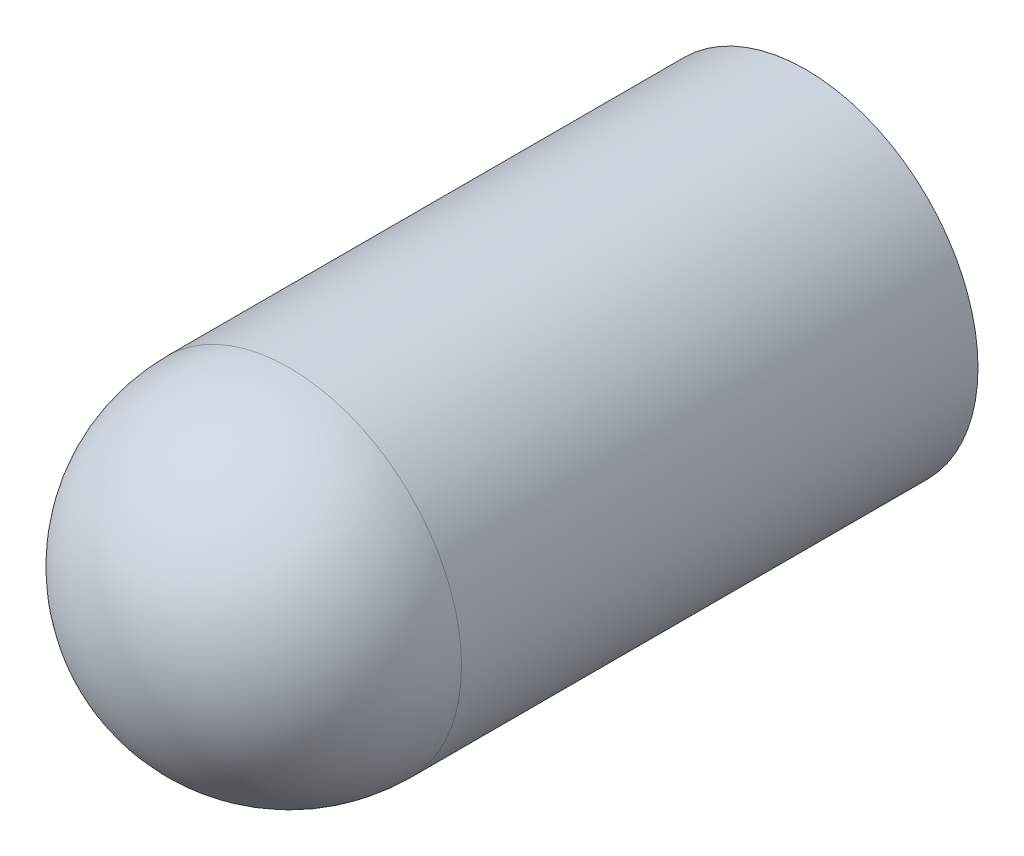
ISO-10303-21;
HEADER;
FILE_DESCRIPTION(('STEP AP214'),'2;1');
FILE_NAME('part.step','',(''),(''),'','','');
FILE_SCHEMA(('AUTOMOTIVE_DESIGN { 1 0 10303 214 1 1 1 1 }'));
ENDSEC;
DATA;
#1=APPLICATION_CONTEXT('core data for automotive mechanical design processes');
#2=APPLICATION_PROTOCOL_DEFINITION('international standard','automotive_design',2000,#1);
#3=PRODUCT_CONTEXT('',#1,'mechanical');
#4=PRODUCT('Part','Part','',(#3));
#5=PRODUCT_RELATED_PRODUCT_CATEGORY('part','',(#4));
#6=PRODUCT_DEFINITION_FORMATION('','',#4);
#7=PRODUCT_DEFINITION_CONTEXT('part definition',#1,'design');
#8=PRODUCT_DEFINITION('design','',#6,#7);
#9=PRODUCT_DEFINITION_SHAPE('','',#8);
#10=(LENGTH_UNIT() NAMED_UNIT(*) SI_UNIT(.MILLI.,.METRE.));
#11=(NAMED_UNIT(*) PLANE_ANGLE_UNIT() SI_UNIT($,.RADIAN.));
#12=(NAMED_UNIT(*) SI_UNIT($,.STERADIAN.) SOLID_ANGLE_UNIT());
#13=UNCERTAINTY_MEASURE_WITH_UNIT(LENGTH_MEASURE(1.E-05),#10,'distance_accuracy_value','');
#14=(GEOMETRIC_REPRESENTATION_CONTEXT(3) GLOBAL_UNCERTAINTY_ASSIGNED_CONTEXT((#13)) GLOBAL_UNIT_ASSIGNED_CONTEXT((#10,
#11,#12)) REPRESENTATION_CONTEXT('',''));
#15=CARTESIAN_POINT('',(0.,0.,0.));
#16=DIRECTION('',(0.,0.,1.));
#17=DIRECTION('',(1.,0.,0.));
#18=AXIS2_PLACEMENT_3D('',#15,#16,#17);
#19=CARTESIAN_POINT('',(0.,0.,40.));
#20=DIRECTION('',(0.,0.,-1.));
#21=DIRECTION('',(-1.,0.,0.));
#22=AXIS2_PLACEMENT_3D('',#19,#20,#21);
#23=CYLINDRICAL_SURFACE('',#22,10.);
#24=CARTESIAN_POINT('',(0.,0.,30.));
#25=DIRECTION('',(0.,0.,-1.));
#26=DIRECTION('',(-1.,0.,0.));
#27=AXIS2_PLACEMENT_3D('',#24,#25,#26);
#28=CIRCLE('',#27,10.);
#29=CARTESIAN_POINT('',(-10.,0.,30.));
#30=VERTEX_POINT('',#29);
#31=EDGE_CURVE('E10',#30,#30,#28,.T.);
#32=ORIENTED_EDGE('',*,*,#31,.T.);
#33=EDGE_LOOP('',(#32));
#34=FACE_BOUND('',#33,.T.);
#35=CARTESIAN_POINT('',(0.,0.,0.));
#36=DIRECTION('',(0.,0.,1.));
#37=DIRECTION('',(1.,0.,0.));
#38=AXIS2_PLACEMENT_3D('',#35,#36,#37);
#39=CIRCLE('',#38,10.);
#40=CARTESIAN_POINT('',(10.,0.,0.));
#41=VERTEX_POINT('',#40);
#42=EDGE_CURVE('E35',#41,#41,#39,.T.);
#43=ORIENTED_EDGE('',*,*,#42,.T.);
#44=EDGE_LOOP('',(#43));
#45=FACE_BOUND('',#44,.T.);
#46=ADVANCED_FACE('F29',(#34,#45),#23,.T.);
#47=CARTESIAN_POINT('',(0.,0.,0.));
#48=DIRECTION('',(0.,0.,1.));
#49=DIRECTION('',(1.,0.,0.));
#50=AXIS2_PLACEMENT_3D('',#47,#48,#49);
#51=PLANE('',#50);
#52=ORIENTED_EDGE('',*,*,#42,.F.);
#53=EDGE_LOOP('',(#52));
#54=FACE_BOUND('',#53,.T.);
#55=ADVANCED_FACE('F42',(#54),#51,.F.);
#56=CARTESIAN_POINT('',(0.,0.,30.));
#57=DIRECTION('',(0.,0.,1.));
#58=DIRECTION('',(1.,0.,0.));
#59=AXIS2_PLACEMENT_3D('',#56,#57,#58);
#60=SPHERICAL_SURFACE('',#59,10.);
#61=ORIENTED_EDGE('',*,*,#31,.F.);
#62=EDGE_LOOP('',(#61));
#63=FACE_BOUND('',#62,.T.);
#64=ADVANCED_FACE('F44',(#63),#60,.T.);
#65=CLOSED_SHELL('',(#46,#55,#64));
#66=MANIFOLD_SOLID_BREP('B2',#65);
#67=ADVANCED_BREP_SHAPE_REPRESENTATION('',(#18,#66),#14);
#68=SHAPE_DEFINITION_REPRESENTATION(#9,#67);
ENDSEC;
END-ISO-10303-21;
